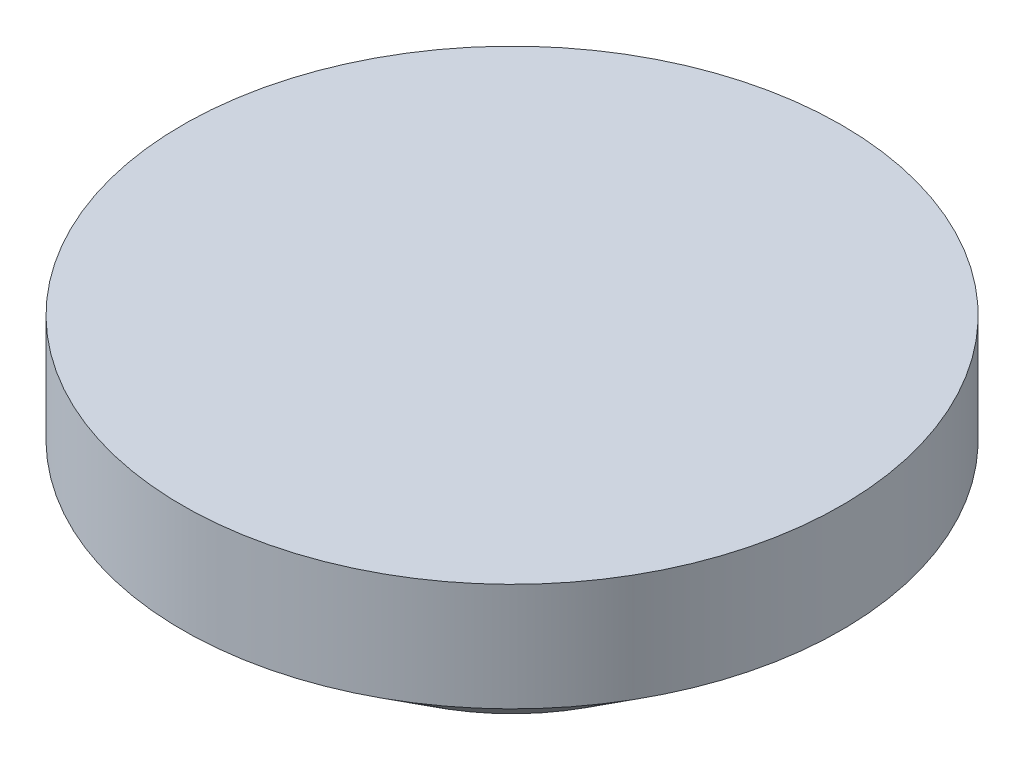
from build123d import *


with BuildPart() as part:
    # Sketch 1 → Revolve 1 (revolve)
    with BuildSketch(Plane.XY, mode=Mode.PRIVATE) as revolve_1_sk:
        Polygon((0, 710), (1100, 710), (1100, 350), (625, 0), (0, 0), align=None)
    revolve(revolve_1_sk.sketch.rotate(Axis((0, 0, 0), (0, 1, 0)), 90), axis=Axis((0, 0, 0), (0, 1, 0)))


solid = part.part
